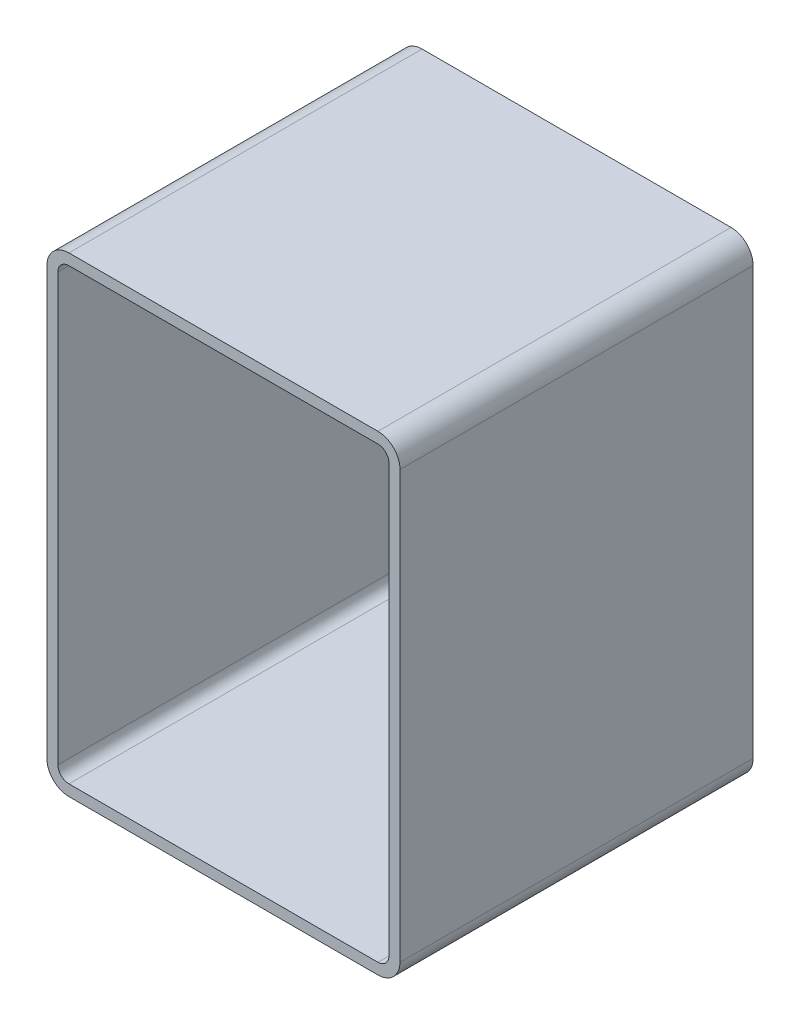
ISO-10303-21;
HEADER;
FILE_DESCRIPTION(('STEP AP214'),'2;1');
FILE_NAME('part.step','',(''),(''),'','','');
FILE_SCHEMA(('AUTOMOTIVE_DESIGN { 1 0 10303 214 1 1 1 1 }'));
ENDSEC;
DATA;
#1=APPLICATION_CONTEXT('core data for automotive mechanical design processes');
#2=APPLICATION_PROTOCOL_DEFINITION('international standard','automotive_design',2000,#1);
#3=PRODUCT_CONTEXT('',#1,'mechanical');
#4=PRODUCT('Part','Part','',(#3));
#5=PRODUCT_RELATED_PRODUCT_CATEGORY('part','',(#4));
#6=PRODUCT_DEFINITION_FORMATION('','',#4);
#7=PRODUCT_DEFINITION_CONTEXT('part definition',#1,'design');
#8=PRODUCT_DEFINITION('design','',#6,#7);
#9=PRODUCT_DEFINITION_SHAPE('','',#8);
#10=(LENGTH_UNIT() NAMED_UNIT(*) SI_UNIT(.MILLI.,.METRE.));
#11=(NAMED_UNIT(*) PLANE_ANGLE_UNIT() SI_UNIT($,.RADIAN.));
#12=(NAMED_UNIT(*) SI_UNIT($,.STERADIAN.) SOLID_ANGLE_UNIT());
#13=UNCERTAINTY_MEASURE_WITH_UNIT(LENGTH_MEASURE(1.E-05),#10,'distance_accuracy_value','');
#14=(GEOMETRIC_REPRESENTATION_CONTEXT(3) GLOBAL_UNCERTAINTY_ASSIGNED_CONTEXT((#13)) GLOBAL_UNIT_ASSIGNED_CONTEXT((#10,
#11,#12)) REPRESENTATION_CONTEXT('',''));
#15=CARTESIAN_POINT('',(0.,0.,0.));
#16=DIRECTION('',(0.,0.,1.));
#17=DIRECTION('',(1.,0.,0.));
#18=AXIS2_PLACEMENT_3D('',#15,#16,#17);
#19=CARTESIAN_POINT('',(20.1567030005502,389.132862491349,304.8));
#20=DIRECTION('',(0.,0.,1.));
#21=DIRECTION('',(1.,0.,0.));
#22=AXIS2_PLACEMENT_3D('',#19,#20,#21);
#23=PLANE('',#22);
#24=CARTESIAN_POINT('',(20.1567030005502,389.132862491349,304.8));
#25=DIRECTION('',(0.,0.,1.));
#26=DIRECTION('',(1.,0.,0.));
#27=AXIS2_PLACEMENT_3D('',#24,#25,#26);
#28=CIRCLE('',#27,19.05);
#29=CARTESIAN_POINT('',(20.1567030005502,408.182862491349,304.8));
#30=VERTEX_POINT('',#29);
#31=CARTESIAN_POINT('',(1.10670300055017,389.132862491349,304.8));
#32=VERTEX_POINT('',#31);
#33=EDGE_CURVE('E211',#30,#32,#28,.T.);
#34=ORIENTED_EDGE('',*,*,#33,.T.);
#35=DIRECTION('',(0.,-1.,0.));
#36=VECTOR('',#35,1.);
#37=CARTESIAN_POINT('',(1.10670300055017,20.8328624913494,304.8));
#38=LINE('',#37,#36);
#39=CARTESIAN_POINT('',(1.10670300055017,20.8328624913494,304.8));
#40=VERTEX_POINT('',#39);
#41=EDGE_CURVE('E214',#32,#40,#38,.T.);
#42=ORIENTED_EDGE('',*,*,#41,.T.);
#43=CARTESIAN_POINT('',(20.1567030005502,20.8328624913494,304.8));
#44=DIRECTION('',(0.,0.,1.));
#45=DIRECTION('',(1.,0.,0.));
#46=AXIS2_PLACEMENT_3D('',#43,#44,#45);
#47=CIRCLE('',#46,19.05);
#48=CARTESIAN_POINT('',(20.1567030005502,1.78286249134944,304.8));
#49=VERTEX_POINT('',#48);
#50=EDGE_CURVE('E217',#40,#49,#47,.T.);
#51=ORIENTED_EDGE('',*,*,#50,.T.);
#52=DIRECTION('',(1.,0.,0.));
#53=VECTOR('',#52,1.);
#54=CARTESIAN_POINT('',(286.85670300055,1.78286249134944,304.8));
#55=LINE('',#54,#53);
#56=CARTESIAN_POINT('',(286.85670300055,1.78286249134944,304.8));
#57=VERTEX_POINT('',#56);
#58=EDGE_CURVE('E219',#49,#57,#55,.T.);
#59=ORIENTED_EDGE('',*,*,#58,.T.);
#60=CARTESIAN_POINT('',(286.85670300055,20.8328624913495,304.8));
#61=DIRECTION('',(0.,0.,1.));
#62=DIRECTION('',(1.,0.,0.));
#63=AXIS2_PLACEMENT_3D('',#60,#61,#62);
#64=CIRCLE('',#63,19.05);
#65=CARTESIAN_POINT('',(305.90670300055,20.8328624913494,304.8));
#66=VERTEX_POINT('',#65);
#67=EDGE_CURVE('E221',#57,#66,#64,.T.);
#68=ORIENTED_EDGE('',*,*,#67,.T.);
#69=DIRECTION('',(0.,1.,0.));
#70=VECTOR('',#69,1.);
#71=CARTESIAN_POINT('',(305.90670300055,389.132862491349,304.8));
#72=LINE('',#71,#70);
#73=CARTESIAN_POINT('',(305.90670300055,389.132862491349,304.8));
#74=VERTEX_POINT('',#73);
#75=EDGE_CURVE('E223',#66,#74,#72,.T.);
#76=ORIENTED_EDGE('',*,*,#75,.T.);
#77=CARTESIAN_POINT('',(286.85670300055,389.132862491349,304.8));
#78=DIRECTION('',(0.,0.,1.));
#79=DIRECTION('',(1.,0.,0.));
#80=AXIS2_PLACEMENT_3D('',#77,#78,#79);
#81=CIRCLE('',#80,19.05);
#82=CARTESIAN_POINT('',(286.85670300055,408.182862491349,304.8));
#83=VERTEX_POINT('',#82);
#84=EDGE_CURVE('E225',#74,#83,#81,.T.);
#85=ORIENTED_EDGE('',*,*,#84,.T.);
#86=DIRECTION('',(-1.,0.,0.));
#87=VECTOR('',#86,1.);
#88=CARTESIAN_POINT('',(20.1567030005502,408.182862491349,304.8));
#89=LINE('',#88,#87);
#90=EDGE_CURVE('E227',#83,#30,#89,.T.);
#91=ORIENTED_EDGE('',*,*,#90,.T.);
#92=EDGE_LOOP('',(#34,#42,#51,#59,#68,#76,#85,#91));
#93=FACE_BOUND('',#92,.T.);
#94=DIRECTION('',(0.,-1.,0.));
#95=VECTOR('',#94,1.);
#96=CARTESIAN_POINT('',(10.6317030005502,20.8328624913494,304.8));
#97=LINE('',#96,#95);
#98=CARTESIAN_POINT('',(10.6317030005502,389.132862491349,304.8));
#99=VERTEX_POINT('',#98);
#100=CARTESIAN_POINT('',(10.6317030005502,20.8328624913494,304.8));
#101=VERTEX_POINT('',#100);
#102=EDGE_CURVE('E154',#99,#101,#97,.T.);
#103=ORIENTED_EDGE('',*,*,#102,.F.);
#104=CARTESIAN_POINT('',(20.1567030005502,389.132862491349,304.8));
#105=DIRECTION('',(0.,0.,1.));
#106=DIRECTION('',(1.,0.,0.));
#107=AXIS2_PLACEMENT_3D('',#104,#105,#106);
#108=CIRCLE('',#107,9.525);
#109=CARTESIAN_POINT('',(20.1567030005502,398.657862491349,304.8));
#110=VERTEX_POINT('',#109);
#111=EDGE_CURVE('E146',#110,#99,#108,.T.);
#112=ORIENTED_EDGE('',*,*,#111,.F.);
#113=DIRECTION('',(-1.,0.,0.));
#114=VECTOR('',#113,1.);
#115=CARTESIAN_POINT('',(20.1567030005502,398.657862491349,304.8));
#116=LINE('',#115,#114);
#117=CARTESIAN_POINT('',(286.85670300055,398.657862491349,304.8));
#118=VERTEX_POINT('',#117);
#119=EDGE_CURVE('E179',#118,#110,#116,.T.);
#120=ORIENTED_EDGE('',*,*,#119,.F.);
#121=CARTESIAN_POINT('',(286.85670300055,389.132862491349,304.8));
#122=DIRECTION('',(0.,0.,1.));
#123=DIRECTION('',(1.,0.,0.));
#124=AXIS2_PLACEMENT_3D('',#121,#122,#123);
#125=CIRCLE('',#124,9.52500000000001);
#126=CARTESIAN_POINT('',(296.38170300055,389.132862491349,304.8));
#127=VERTEX_POINT('',#126);
#128=EDGE_CURVE('E177',#127,#118,#125,.T.);
#129=ORIENTED_EDGE('',*,*,#128,.F.);
#130=DIRECTION('',(0.,1.,0.));
#131=VECTOR('',#130,1.);
#132=CARTESIAN_POINT('',(296.38170300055,389.132862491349,304.8));
#133=LINE('',#132,#131);
#134=CARTESIAN_POINT('',(296.38170300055,20.8328624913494,304.8));
#135=VERTEX_POINT('',#134);
#136=EDGE_CURVE('E175',#135,#127,#133,.T.);
#137=ORIENTED_EDGE('',*,*,#136,.F.);
#138=CARTESIAN_POINT('',(286.85670300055,20.8328624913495,304.8));
#139=DIRECTION('',(0.,0.,1.));
#140=DIRECTION('',(1.,0.,0.));
#141=AXIS2_PLACEMENT_3D('',#138,#139,#140);
#142=CIRCLE('',#141,9.52500000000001);
#143=CARTESIAN_POINT('',(286.85670300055,11.3078624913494,304.8));
#144=VERTEX_POINT('',#143);
#145=EDGE_CURVE('E173',#144,#135,#142,.T.);
#146=ORIENTED_EDGE('',*,*,#145,.F.);
#147=DIRECTION('',(1.,0.,0.));
#148=VECTOR('',#147,1.);
#149=CARTESIAN_POINT('',(286.85670300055,11.3078624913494,304.8));
#150=LINE('',#149,#148);
#151=CARTESIAN_POINT('',(20.1567030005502,11.3078624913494,304.8));
#152=VERTEX_POINT('',#151);
#153=EDGE_CURVE('E169',#152,#144,#150,.T.);
#154=ORIENTED_EDGE('',*,*,#153,.F.);
#155=CARTESIAN_POINT('',(20.1567030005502,20.8328624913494,304.8));
#156=DIRECTION('',(0.,0.,1.));
#157=DIRECTION('',(1.,0.,0.));
#158=AXIS2_PLACEMENT_3D('',#155,#156,#157);
#159=CIRCLE('',#158,9.525);
#160=EDGE_CURVE('E167',#101,#152,#159,.T.);
#161=ORIENTED_EDGE('',*,*,#160,.F.);
#162=EDGE_LOOP('',(#103,#112,#120,#129,#137,#146,#154,#161));
#163=FACE_BOUND('',#162,.T.);
#164=ADVANCED_FACE('F33',(#93,#163),#23,.T.);
#165=CARTESIAN_POINT('',(20.1567030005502,389.132862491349,0.));
#166=DIRECTION('',(0.,0.,1.));
#167=DIRECTION('',(1.,0.,0.));
#168=AXIS2_PLACEMENT_3D('',#165,#166,#167);
#169=PLANE('',#168);
#170=CARTESIAN_POINT('',(20.1567030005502,389.132862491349,0.));
#171=DIRECTION('',(0.,0.,1.));
#172=DIRECTION('',(1.,0.,0.));
#173=AXIS2_PLACEMENT_3D('',#170,#171,#172);
#174=CIRCLE('',#173,19.05);
#175=CARTESIAN_POINT('',(20.1567030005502,408.182862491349,0.));
#176=VERTEX_POINT('',#175);
#177=CARTESIAN_POINT('',(1.10670300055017,389.132862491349,0.));
#178=VERTEX_POINT('',#177);
#179=EDGE_CURVE('E162',#176,#178,#174,.T.);
#180=ORIENTED_EDGE('',*,*,#179,.F.);
#181=DIRECTION('',(-1.,0.,0.));
#182=VECTOR('',#181,1.);
#183=CARTESIAN_POINT('',(20.1567030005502,408.182862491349,0.));
#184=LINE('',#183,#182);
#185=CARTESIAN_POINT('',(286.85670300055,408.182862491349,0.));
#186=VERTEX_POINT('',#185);
#187=EDGE_CURVE('E215',#186,#176,#184,.T.);
#188=ORIENTED_EDGE('',*,*,#187,.F.);
#189=CARTESIAN_POINT('',(286.85670300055,389.132862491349,0.));
#190=DIRECTION('',(0.,0.,1.));
#191=DIRECTION('',(1.,0.,0.));
#192=AXIS2_PLACEMENT_3D('',#189,#190,#191);
#193=CIRCLE('',#192,19.05);
#194=CARTESIAN_POINT('',(305.90670300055,389.132862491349,0.));
#195=VERTEX_POINT('',#194);
#196=EDGE_CURVE('E242',#195,#186,#193,.T.);
#197=ORIENTED_EDGE('',*,*,#196,.F.);
#198=DIRECTION('',(0.,1.,0.));
#199=VECTOR('',#198,1.);
#200=CARTESIAN_POINT('',(305.90670300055,389.132862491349,0.));
#201=LINE('',#200,#199);
#202=CARTESIAN_POINT('',(305.90670300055,20.8328624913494,0.));
#203=VERTEX_POINT('',#202);
#204=EDGE_CURVE('E240',#203,#195,#201,.T.);
#205=ORIENTED_EDGE('',*,*,#204,.F.);
#206=CARTESIAN_POINT('',(286.85670300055,20.8328624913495,0.));
#207=DIRECTION('',(0.,0.,1.));
#208=DIRECTION('',(1.,0.,0.));
#209=AXIS2_PLACEMENT_3D('',#206,#207,#208);
#210=CIRCLE('',#209,19.05);
#211=CARTESIAN_POINT('',(286.85670300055,1.78286249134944,0.));
#212=VERTEX_POINT('',#211);
#213=EDGE_CURVE('E238',#212,#203,#210,.T.);
#214=ORIENTED_EDGE('',*,*,#213,.F.);
#215=DIRECTION('',(1.,0.,0.));
#216=VECTOR('',#215,1.);
#217=CARTESIAN_POINT('',(286.85670300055,1.78286249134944,0.));
#218=LINE('',#217,#216);
#219=CARTESIAN_POINT('',(20.1567030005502,1.78286249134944,0.));
#220=VERTEX_POINT('',#219);
#221=EDGE_CURVE('E236',#220,#212,#218,.T.);
#222=ORIENTED_EDGE('',*,*,#221,.F.);
#223=CARTESIAN_POINT('',(20.1567030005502,20.8328624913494,0.));
#224=DIRECTION('',(0.,0.,1.));
#225=DIRECTION('',(1.,0.,0.));
#226=AXIS2_PLACEMENT_3D('',#223,#224,#225);
#227=CIRCLE('',#226,19.05);
#228=CARTESIAN_POINT('',(1.10670300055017,20.8328624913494,0.));
#229=VERTEX_POINT('',#228);
#230=EDGE_CURVE('E234',#229,#220,#227,.T.);
#231=ORIENTED_EDGE('',*,*,#230,.F.);
#232=DIRECTION('',(0.,-1.,0.));
#233=VECTOR('',#232,1.);
#234=CARTESIAN_POINT('',(1.10670300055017,20.8328624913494,0.));
#235=LINE('',#234,#233);
#236=EDGE_CURVE('E232',#178,#229,#235,.T.);
#237=ORIENTED_EDGE('',*,*,#236,.F.);
#238=EDGE_LOOP('',(#180,#188,#197,#205,#214,#222,#231,#237));
#239=FACE_BOUND('',#238,.T.);
#240=CARTESIAN_POINT('',(20.1567030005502,389.132862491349,0.));
#241=DIRECTION('',(0.,0.,1.));
#242=DIRECTION('',(1.,0.,0.));
#243=AXIS2_PLACEMENT_3D('',#240,#241,#242);
#244=CIRCLE('',#243,9.525);
#245=CARTESIAN_POINT('',(20.1567030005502,398.657862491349,0.));
#246=VERTEX_POINT('',#245);
#247=CARTESIAN_POINT('',(10.6317030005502,389.132862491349,0.));
#248=VERTEX_POINT('',#247);
#249=EDGE_CURVE('E56',#246,#248,#244,.T.);
#250=ORIENTED_EDGE('',*,*,#249,.T.);
#251=DIRECTION('',(0.,-1.,0.));
#252=VECTOR('',#251,1.);
#253=CARTESIAN_POINT('',(10.6317030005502,20.8328624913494,0.));
#254=LINE('',#253,#252);
#255=CARTESIAN_POINT('',(10.6317030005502,20.8328624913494,0.));
#256=VERTEX_POINT('',#255);
#257=EDGE_CURVE('E161',#248,#256,#254,.T.);
#258=ORIENTED_EDGE('',*,*,#257,.T.);
#259=CARTESIAN_POINT('',(20.1567030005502,20.8328624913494,0.));
#260=DIRECTION('',(0.,0.,1.));
#261=DIRECTION('',(1.,0.,0.));
#262=AXIS2_PLACEMENT_3D('',#259,#260,#261);
#263=CIRCLE('',#262,9.525);
#264=CARTESIAN_POINT('',(20.1567030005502,11.3078624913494,0.));
#265=VERTEX_POINT('',#264);
#266=EDGE_CURVE('E183',#256,#265,#263,.T.);
#267=ORIENTED_EDGE('',*,*,#266,.T.);
#268=DIRECTION('',(1.,0.,0.));
#269=VECTOR('',#268,1.);
#270=CARTESIAN_POINT('',(286.85670300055,11.3078624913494,0.));
#271=LINE('',#270,#269);
#272=CARTESIAN_POINT('',(286.85670300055,11.3078624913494,0.));
#273=VERTEX_POINT('',#272);
#274=EDGE_CURVE('E186',#265,#273,#271,.T.);
#275=ORIENTED_EDGE('',*,*,#274,.T.);
#276=CARTESIAN_POINT('',(286.85670300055,20.8328624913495,0.));
#277=DIRECTION('',(0.,0.,1.));
#278=DIRECTION('',(1.,0.,0.));
#279=AXIS2_PLACEMENT_3D('',#276,#277,#278);
#280=CIRCLE('',#279,9.52500000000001);
#281=CARTESIAN_POINT('',(296.38170300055,20.8328624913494,0.));
#282=VERTEX_POINT('',#281);
#283=EDGE_CURVE('E189',#273,#282,#280,.T.);
#284=ORIENTED_EDGE('',*,*,#283,.T.);
#285=DIRECTION('',(0.,1.,0.));
#286=VECTOR('',#285,1.);
#287=CARTESIAN_POINT('',(296.38170300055,389.132862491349,0.));
#288=LINE('',#287,#286);
#289=CARTESIAN_POINT('',(296.38170300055,389.132862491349,0.));
#290=VERTEX_POINT('',#289);
#291=EDGE_CURVE('E192',#282,#290,#288,.T.);
#292=ORIENTED_EDGE('',*,*,#291,.T.);
#293=CARTESIAN_POINT('',(286.85670300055,389.132862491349,0.));
#294=DIRECTION('',(0.,0.,1.));
#295=DIRECTION('',(1.,0.,0.));
#296=AXIS2_PLACEMENT_3D('',#293,#294,#295);
#297=CIRCLE('',#296,9.52500000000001);
#298=CARTESIAN_POINT('',(286.85670300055,398.657862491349,0.));
#299=VERTEX_POINT('',#298);
#300=EDGE_CURVE('E195',#290,#299,#297,.T.);
#301=ORIENTED_EDGE('',*,*,#300,.T.);
#302=DIRECTION('',(-1.,0.,0.));
#303=VECTOR('',#302,1.);
#304=CARTESIAN_POINT('',(20.1567030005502,398.657862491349,0.));
#305=LINE('',#304,#303);
#306=EDGE_CURVE('E155',#299,#246,#305,.T.);
#307=ORIENTED_EDGE('',*,*,#306,.T.);
#308=EDGE_LOOP('',(#250,#258,#267,#275,#284,#292,#301,#307));
#309=FACE_BOUND('',#308,.T.);
#310=ADVANCED_FACE('F272',(#239,#309),#169,.F.);
#311=CARTESIAN_POINT('',(20.1567030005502,389.132862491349,304.8));
#312=DIRECTION('',(0.,0.,-1.));
#313=DIRECTION('',(-1.,0.,0.));
#314=AXIS2_PLACEMENT_3D('',#311,#312,#313);
#315=CYLINDRICAL_SURFACE('',#314,19.05);
#316=ORIENTED_EDGE('',*,*,#179,.T.);
#317=DIRECTION('',(0.,0.,-1.));
#318=VECTOR('',#317,1.);
#319=CARTESIAN_POINT('',(1.10670300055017,389.132862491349,304.8));
#320=LINE('',#319,#318);
#321=EDGE_CURVE('E11',#32,#178,#320,.T.);
#322=ORIENTED_EDGE('',*,*,#321,.F.);
#323=ORIENTED_EDGE('',*,*,#33,.F.);
#324=DIRECTION('',(0.,0.,-1.));
#325=VECTOR('',#324,1.);
#326=CARTESIAN_POINT('',(20.1567030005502,408.182862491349,304.8));
#327=LINE('',#326,#325);
#328=EDGE_CURVE('E229',#30,#176,#327,.T.);
#329=ORIENTED_EDGE('',*,*,#328,.T.);
#330=EDGE_LOOP('',(#316,#322,#323,#329));
#331=FACE_BOUND('',#330,.T.);
#332=ADVANCED_FACE('F35',(#331),#315,.T.);
#333=CARTESIAN_POINT('',(1.10670300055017,20.8328624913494,304.8));
#334=DIRECTION('',(1.,0.,0.));
#335=DIRECTION('',(0.,0.,-1.));
#336=AXIS2_PLACEMENT_3D('',#333,#334,#335);
#337=PLANE('',#336);
#338=ORIENTED_EDGE('',*,*,#236,.T.);
#339=DIRECTION('',(0.,0.,-1.));
#340=VECTOR('',#339,1.);
#341=CARTESIAN_POINT('',(1.10670300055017,20.8328624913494,304.8));
#342=LINE('',#341,#340);
#343=EDGE_CURVE('E41',#40,#229,#342,.T.);
#344=ORIENTED_EDGE('',*,*,#343,.F.);
#345=ORIENTED_EDGE('',*,*,#41,.F.);
#346=ORIENTED_EDGE('',*,*,#321,.T.);
#347=EDGE_LOOP('',(#338,#344,#345,#346));
#348=FACE_BOUND('',#347,.T.);
#349=ADVANCED_FACE('F289',(#348),#337,.F.);
#350=CARTESIAN_POINT('',(20.1567030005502,20.8328624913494,304.8));
#351=DIRECTION('',(0.,0.,-1.));
#352=DIRECTION('',(-1.,0.,0.));
#353=AXIS2_PLACEMENT_3D('',#350,#351,#352);
#354=CYLINDRICAL_SURFACE('',#353,19.05);
#355=ORIENTED_EDGE('',*,*,#230,.T.);
#356=DIRECTION('',(0.,0.,-1.));
#357=VECTOR('',#356,1.);
#358=CARTESIAN_POINT('',(20.1567030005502,1.78286249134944,304.8));
#359=LINE('',#358,#357);
#360=EDGE_CURVE('E259',#49,#220,#359,.T.);
#361=ORIENTED_EDGE('',*,*,#360,.F.);
#362=ORIENTED_EDGE('',*,*,#50,.F.);
#363=ORIENTED_EDGE('',*,*,#343,.T.);
#364=EDGE_LOOP('',(#355,#361,#362,#363));
#365=FACE_BOUND('',#364,.T.);
#366=ADVANCED_FACE('F266',(#365),#354,.T.);
#367=CARTESIAN_POINT('',(286.85670300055,1.78286249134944,304.8));
#368=DIRECTION('',(0.,1.,0.));
#369=DIRECTION('',(0.,0.,1.));
#370=AXIS2_PLACEMENT_3D('',#367,#368,#369);
#371=PLANE('',#370);
#372=ORIENTED_EDGE('',*,*,#221,.T.);
#373=DIRECTION('',(0.,0.,-1.));
#374=VECTOR('',#373,1.);
#375=CARTESIAN_POINT('',(286.85670300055,1.78286249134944,304.8));
#376=LINE('',#375,#374);
#377=EDGE_CURVE('E256',#57,#212,#376,.T.);
#378=ORIENTED_EDGE('',*,*,#377,.F.);
#379=ORIENTED_EDGE('',*,*,#58,.F.);
#380=ORIENTED_EDGE('',*,*,#360,.T.);
#381=EDGE_LOOP('',(#372,#378,#379,#380));
#382=FACE_BOUND('',#381,.T.);
#383=ADVANCED_FACE('F278',(#382),#371,.F.);
#384=CARTESIAN_POINT('',(286.85670300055,20.8328624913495,304.8));
#385=DIRECTION('',(0.,0.,-1.));
#386=DIRECTION('',(-1.,0.,0.));
#387=AXIS2_PLACEMENT_3D('',#384,#385,#386);
#388=CYLINDRICAL_SURFACE('',#387,19.05);
#389=ORIENTED_EDGE('',*,*,#213,.T.);
#390=DIRECTION('',(0.,0.,-1.));
#391=VECTOR('',#390,1.);
#392=CARTESIAN_POINT('',(305.90670300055,20.8328624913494,304.8));
#393=LINE('',#392,#391);
#394=EDGE_CURVE('E253',#66,#203,#393,.T.);
#395=ORIENTED_EDGE('',*,*,#394,.F.);
#396=ORIENTED_EDGE('',*,*,#67,.F.);
#397=ORIENTED_EDGE('',*,*,#377,.T.);
#398=EDGE_LOOP('',(#389,#395,#396,#397));
#399=FACE_BOUND('',#398,.T.);
#400=ADVANCED_FACE('F282',(#399),#388,.T.);
#401=CARTESIAN_POINT('',(305.90670300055,389.132862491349,304.8));
#402=DIRECTION('',(-1.,0.,0.));
#403=DIRECTION('',(0.,0.,1.));
#404=AXIS2_PLACEMENT_3D('',#401,#402,#403);
#405=PLANE('',#404);
#406=ORIENTED_EDGE('',*,*,#204,.T.);
#407=DIRECTION('',(0.,0.,-1.));
#408=VECTOR('',#407,1.);
#409=CARTESIAN_POINT('',(305.90670300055,389.132862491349,304.8));
#410=LINE('',#409,#408);
#411=EDGE_CURVE('E250',#74,#195,#410,.T.);
#412=ORIENTED_EDGE('',*,*,#411,.F.);
#413=ORIENTED_EDGE('',*,*,#75,.F.);
#414=ORIENTED_EDGE('',*,*,#394,.T.);
#415=EDGE_LOOP('',(#406,#412,#413,#414));
#416=FACE_BOUND('',#415,.T.);
#417=ADVANCED_FACE('F302',(#416),#405,.F.);
#418=CARTESIAN_POINT('',(286.85670300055,389.132862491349,304.8));
#419=DIRECTION('',(0.,0.,-1.));
#420=DIRECTION('',(-1.,0.,0.));
#421=AXIS2_PLACEMENT_3D('',#418,#419,#420);
#422=CYLINDRICAL_SURFACE('',#421,19.05);
#423=ORIENTED_EDGE('',*,*,#196,.T.);
#424=DIRECTION('',(0.,0.,-1.));
#425=VECTOR('',#424,1.);
#426=CARTESIAN_POINT('',(286.85670300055,408.182862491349,304.8));
#427=LINE('',#426,#425);
#428=EDGE_CURVE('E247',#83,#186,#427,.T.);
#429=ORIENTED_EDGE('',*,*,#428,.F.);
#430=ORIENTED_EDGE('',*,*,#84,.F.);
#431=ORIENTED_EDGE('',*,*,#411,.T.);
#432=EDGE_LOOP('',(#423,#429,#430,#431));
#433=FACE_BOUND('',#432,.T.);
#434=ADVANCED_FACE('F300',(#433),#422,.T.);
#435=CARTESIAN_POINT('',(20.1567030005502,408.182862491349,304.8));
#436=DIRECTION('',(0.,-1.,0.));
#437=DIRECTION('',(0.,0.,-1.));
#438=AXIS2_PLACEMENT_3D('',#435,#436,#437);
#439=PLANE('',#438);
#440=ORIENTED_EDGE('',*,*,#187,.T.);
#441=ORIENTED_EDGE('',*,*,#328,.F.);
#442=ORIENTED_EDGE('',*,*,#90,.F.);
#443=ORIENTED_EDGE('',*,*,#428,.T.);
#444=EDGE_LOOP('',(#440,#441,#442,#443));
#445=FACE_BOUND('',#444,.T.);
#446=ADVANCED_FACE('F295',(#445),#439,.F.);
#447=CARTESIAN_POINT('',(20.1567030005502,389.132862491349,304.8));
#448=DIRECTION('',(0.,0.,-1.));
#449=DIRECTION('',(-1.,0.,0.));
#450=AXIS2_PLACEMENT_3D('',#447,#448,#449);
#451=CYLINDRICAL_SURFACE('',#450,9.525);
#452=ORIENTED_EDGE('',*,*,#249,.F.);
#453=DIRECTION('',(0.,0.,-1.));
#454=VECTOR('',#453,1.);
#455=CARTESIAN_POINT('',(20.1567030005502,398.657862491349,304.8));
#456=LINE('',#455,#454);
#457=EDGE_CURVE('E150',#110,#246,#456,.T.);
#458=ORIENTED_EDGE('',*,*,#457,.F.);
#459=ORIENTED_EDGE('',*,*,#111,.T.);
#460=DIRECTION('',(0.,0.,-1.));
#461=VECTOR('',#460,1.);
#462=CARTESIAN_POINT('',(10.6317030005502,389.132862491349,304.8));
#463=LINE('',#462,#461);
#464=EDGE_CURVE('E149',#99,#248,#463,.T.);
#465=ORIENTED_EDGE('',*,*,#464,.T.);
#466=EDGE_LOOP('',(#452,#458,#459,#465));
#467=FACE_BOUND('',#466,.T.);
#468=ADVANCED_FACE('F148',(#467),#451,.F.);
#469=CARTESIAN_POINT('',(10.6317030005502,20.8328624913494,304.8));
#470=DIRECTION('',(1.,0.,0.));
#471=DIRECTION('',(0.,0.,-1.));
#472=AXIS2_PLACEMENT_3D('',#469,#470,#471);
#473=PLANE('',#472);
#474=ORIENTED_EDGE('',*,*,#257,.F.);
#475=ORIENTED_EDGE('',*,*,#464,.F.);
#476=ORIENTED_EDGE('',*,*,#102,.T.);
#477=DIRECTION('',(0.,0.,-1.));
#478=VECTOR('',#477,1.);
#479=CARTESIAN_POINT('',(10.6317030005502,20.8328624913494,304.8));
#480=LINE('',#479,#478);
#481=EDGE_CURVE('E163',#101,#256,#480,.T.);
#482=ORIENTED_EDGE('',*,*,#481,.T.);
#483=EDGE_LOOP('',(#474,#475,#476,#482));
#484=FACE_BOUND('',#483,.T.);
#485=ADVANCED_FACE('F158',(#484),#473,.T.);
#486=CARTESIAN_POINT('',(20.1567030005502,20.8328624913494,304.8));
#487=DIRECTION('',(0.,0.,-1.));
#488=DIRECTION('',(-1.,0.,0.));
#489=AXIS2_PLACEMENT_3D('',#486,#487,#488);
#490=CYLINDRICAL_SURFACE('',#489,9.525);
#491=ORIENTED_EDGE('',*,*,#266,.F.);
#492=ORIENTED_EDGE('',*,*,#481,.F.);
#493=ORIENTED_EDGE('',*,*,#160,.T.);
#494=DIRECTION('',(0.,0.,-1.));
#495=VECTOR('',#494,1.);
#496=CARTESIAN_POINT('',(20.1567030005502,11.3078624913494,304.8));
#497=LINE('',#496,#495);
#498=EDGE_CURVE('E208',#152,#265,#497,.T.);
#499=ORIENTED_EDGE('',*,*,#498,.T.);
#500=EDGE_LOOP('',(#491,#492,#493,#499));
#501=FACE_BOUND('',#500,.T.);
#502=ADVANCED_FACE('F327',(#501),#490,.F.);
#503=CARTESIAN_POINT('',(286.85670300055,11.3078624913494,304.8));
#504=DIRECTION('',(0.,1.,0.));
#505=DIRECTION('',(0.,0.,1.));
#506=AXIS2_PLACEMENT_3D('',#503,#504,#505);
#507=PLANE('',#506);
#508=ORIENTED_EDGE('',*,*,#274,.F.);
#509=ORIENTED_EDGE('',*,*,#498,.F.);
#510=ORIENTED_EDGE('',*,*,#153,.T.);
#511=DIRECTION('',(0.,0.,-1.));
#512=VECTOR('',#511,1.);
#513=CARTESIAN_POINT('',(286.85670300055,11.3078624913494,304.8));
#514=LINE('',#513,#512);
#515=EDGE_CURVE('E206',#144,#273,#514,.T.);
#516=ORIENTED_EDGE('',*,*,#515,.T.);
#517=EDGE_LOOP('',(#508,#509,#510,#516));
#518=FACE_BOUND('',#517,.T.);
#519=ADVANCED_FACE('F331',(#518),#507,.T.);
#520=CARTESIAN_POINT('',(286.85670300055,20.8328624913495,304.8));
#521=DIRECTION('',(0.,0.,-1.));
#522=DIRECTION('',(-1.,0.,0.));
#523=AXIS2_PLACEMENT_3D('',#520,#521,#522);
#524=CYLINDRICAL_SURFACE('',#523,9.52500000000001);
#525=ORIENTED_EDGE('',*,*,#283,.F.);
#526=ORIENTED_EDGE('',*,*,#515,.F.);
#527=ORIENTED_EDGE('',*,*,#145,.T.);
#528=DIRECTION('',(0.,0.,-1.));
#529=VECTOR('',#528,1.);
#530=CARTESIAN_POINT('',(296.38170300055,20.8328624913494,304.8));
#531=LINE('',#530,#529);
#532=EDGE_CURVE('E204',#135,#282,#531,.T.);
#533=ORIENTED_EDGE('',*,*,#532,.T.);
#534=EDGE_LOOP('',(#525,#526,#527,#533));
#535=FACE_BOUND('',#534,.T.);
#536=ADVANCED_FACE('F337',(#535),#524,.F.);
#537=CARTESIAN_POINT('',(296.38170300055,389.132862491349,304.8));
#538=DIRECTION('',(-1.,0.,0.));
#539=DIRECTION('',(0.,0.,1.));
#540=AXIS2_PLACEMENT_3D('',#537,#538,#539);
#541=PLANE('',#540);
#542=ORIENTED_EDGE('',*,*,#291,.F.);
#543=ORIENTED_EDGE('',*,*,#532,.F.);
#544=ORIENTED_EDGE('',*,*,#136,.T.);
#545=DIRECTION('',(0.,0.,-1.));
#546=VECTOR('',#545,1.);
#547=CARTESIAN_POINT('',(296.38170300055,389.132862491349,304.8));
#548=LINE('',#547,#546);
#549=EDGE_CURVE('E202',#127,#290,#548,.T.);
#550=ORIENTED_EDGE('',*,*,#549,.T.);
#551=EDGE_LOOP('',(#542,#543,#544,#550));
#552=FACE_BOUND('',#551,.T.);
#553=ADVANCED_FACE('F341',(#552),#541,.T.);
#554=CARTESIAN_POINT('',(286.85670300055,389.132862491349,304.8));
#555=DIRECTION('',(0.,0.,-1.));
#556=DIRECTION('',(-1.,0.,0.));
#557=AXIS2_PLACEMENT_3D('',#554,#555,#556);
#558=CYLINDRICAL_SURFACE('',#557,9.52500000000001);
#559=ORIENTED_EDGE('',*,*,#300,.F.);
#560=ORIENTED_EDGE('',*,*,#549,.F.);
#561=ORIENTED_EDGE('',*,*,#128,.T.);
#562=DIRECTION('',(0.,0.,-1.));
#563=VECTOR('',#562,1.);
#564=CARTESIAN_POINT('',(286.85670300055,398.657862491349,304.8));
#565=LINE('',#564,#563);
#566=EDGE_CURVE('E48',#118,#299,#565,.T.);
#567=ORIENTED_EDGE('',*,*,#566,.T.);
#568=EDGE_LOOP('',(#559,#560,#561,#567));
#569=FACE_BOUND('',#568,.T.);
#570=ADVANCED_FACE('F345',(#569),#558,.F.);
#571=CARTESIAN_POINT('',(20.1567030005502,398.657862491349,304.8));
#572=DIRECTION('',(0.,-1.,0.));
#573=DIRECTION('',(0.,0.,-1.));
#574=AXIS2_PLACEMENT_3D('',#571,#572,#573);
#575=PLANE('',#574);
#576=ORIENTED_EDGE('',*,*,#306,.F.);
#577=ORIENTED_EDGE('',*,*,#566,.F.);
#578=ORIENTED_EDGE('',*,*,#119,.T.);
#579=ORIENTED_EDGE('',*,*,#457,.T.);
#580=EDGE_LOOP('',(#576,#577,#578,#579));
#581=FACE_BOUND('',#580,.T.);
#582=ADVANCED_FACE('F349',(#581),#575,.T.);
#583=CLOSED_SHELL('',(#164,#310,#332,#349,#366,#383,#400,#417,#434,#446,#468,#485,#502,#519,
#536,#553,#570,#582));
#584=MANIFOLD_SOLID_BREP('B2',#583);
#585=ADVANCED_BREP_SHAPE_REPRESENTATION('',(#18,#584),#14);
#586=SHAPE_DEFINITION_REPRESENTATION(#9,#585);
ENDSEC;
END-ISO-10303-21;
